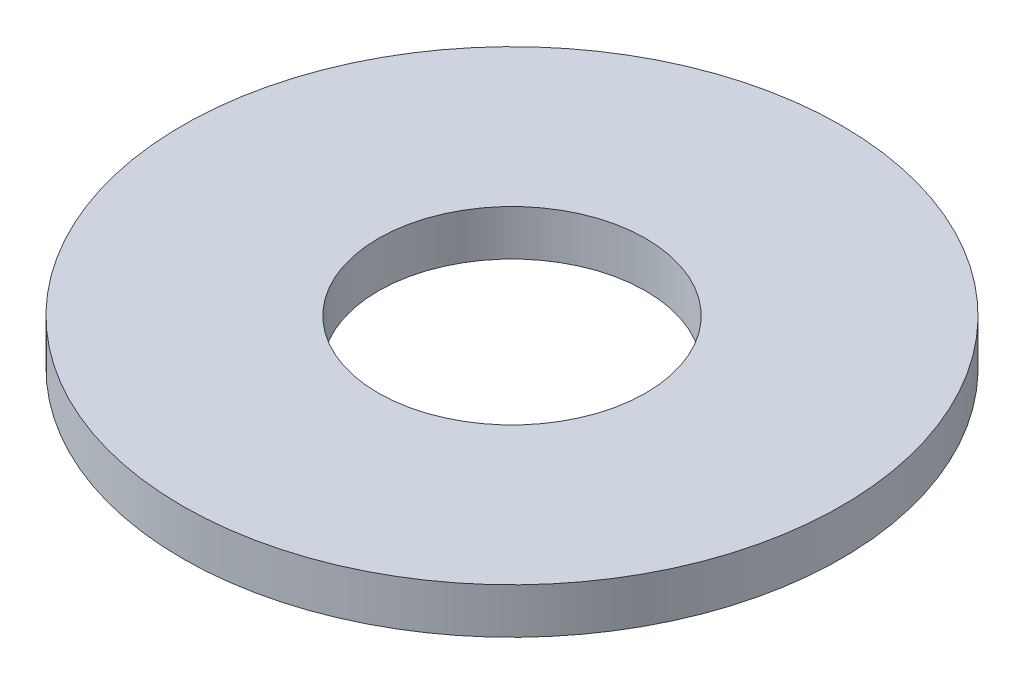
from build123d import *

# Parameters (mm, degrees)
SKETCH1_R      = 12.7
SKETCH1_R_2    = 5.1562
EXTRUDE1_DEPTH = 1.7526


with BuildPart() as part:
    # Sketch1 → Extrude1 (new body)
    with BuildSketch(Plane(origin=(0, 0, 0), x_dir=(1, 0, 0), z_dir=(0, 1, 0))):
        with Locations(Location((0, 0, 0), (0, 0, 270))):
            Circle(SKETCH1_R)
        with Locations(Location((0, 0, 0), (0, 0, 270))):
            Circle(SKETCH1_R_2, mode=Mode.SUBTRACT)
    extrude(amount=EXTRUDE1_DEPTH)


solid = part.part
